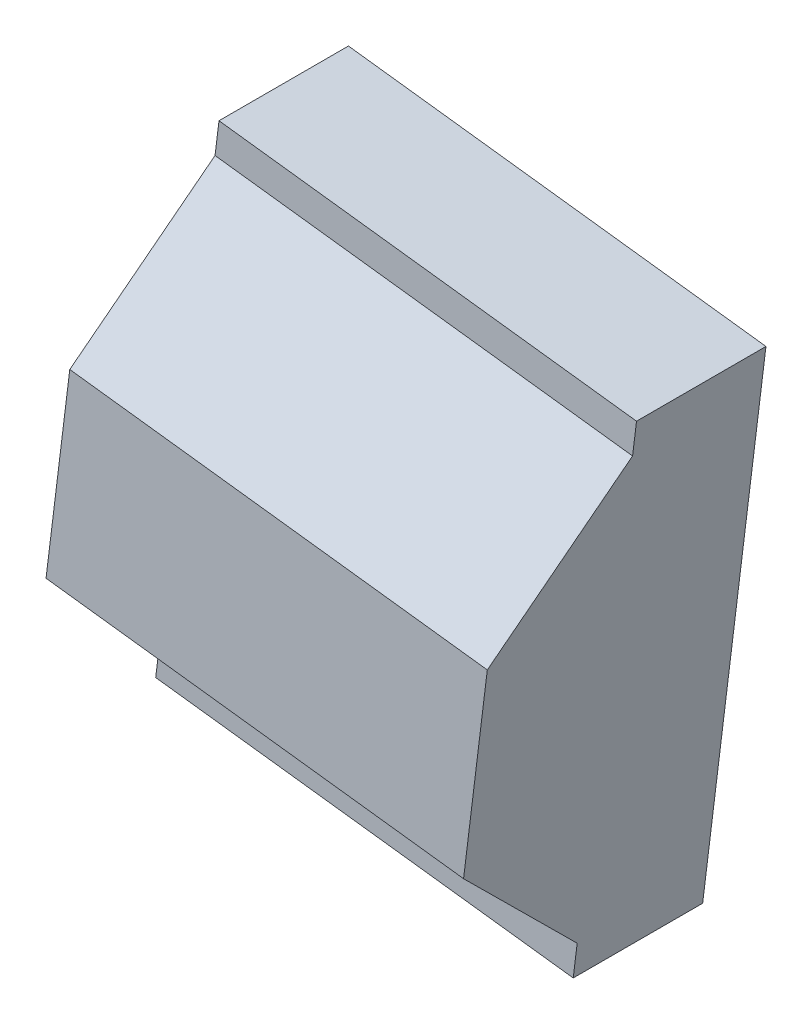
ISO-10303-21;
HEADER;
FILE_DESCRIPTION(('STEP AP214'),'2;1');
FILE_NAME('part.step','',(''),(''),'','','');
FILE_SCHEMA(('AUTOMOTIVE_DESIGN { 1 0 10303 214 1 1 1 1 }'));
ENDSEC;
DATA;
#1=APPLICATION_CONTEXT('core data for automotive mechanical design processes');
#2=APPLICATION_PROTOCOL_DEFINITION('international standard','automotive_design',2000,#1);
#3=PRODUCT_CONTEXT('',#1,'mechanical');
#4=PRODUCT('Part','Part','',(#3));
#5=PRODUCT_RELATED_PRODUCT_CATEGORY('part','',(#4));
#6=PRODUCT_DEFINITION_FORMATION('','',#4);
#7=PRODUCT_DEFINITION_CONTEXT('part definition',#1,'design');
#8=PRODUCT_DEFINITION('design','',#6,#7);
#9=PRODUCT_DEFINITION_SHAPE('','',#8);
#10=(LENGTH_UNIT() NAMED_UNIT(*) SI_UNIT(.MILLI.,.METRE.));
#11=(NAMED_UNIT(*) PLANE_ANGLE_UNIT() SI_UNIT($,.RADIAN.));
#12=(NAMED_UNIT(*) SI_UNIT($,.STERADIAN.) SOLID_ANGLE_UNIT());
#13=UNCERTAINTY_MEASURE_WITH_UNIT(LENGTH_MEASURE(1.E-05),#10,'distance_accuracy_value','');
#14=(GEOMETRIC_REPRESENTATION_CONTEXT(3) GLOBAL_UNCERTAINTY_ASSIGNED_CONTEXT((#13)) GLOBAL_UNIT_ASSIGNED_CONTEXT((#10,
#11,#12)) REPRESENTATION_CONTEXT('',''));
#15=CARTESIAN_POINT('',(0.,0.,0.));
#16=DIRECTION('',(0.,0.,1.));
#17=DIRECTION('',(1.,0.,0.));
#18=AXIS2_PLACEMENT_3D('',#15,#16,#17);
#19=CARTESIAN_POINT('',(54.4377734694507,-51.4921056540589,0.));
#20=DIRECTION('',(0.,0.,1.));
#21=DIRECTION('',(1.,0.,0.));
#22=AXIS2_PLACEMENT_3D('',#19,#20,#21);
#23=PLANE('',#22);
#24=DIRECTION('',(-0.122264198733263,-0.99249758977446,0.));
#25=VECTOR('',#24,1.);
#26=CARTESIAN_POINT('',(-34.7543167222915,55.465332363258,0.));
#27=LINE('',#26,#25);
#28=CARTESIAN_POINT('',(-47.1763593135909,-45.3724227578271,0.));
#29=VERTEX_POINT('',#28);
#30=CARTESIAN_POINT('',(-46.399981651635,-39.0700630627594,0.));
#31=VERTEX_POINT('',#30);
#32=EDGE_CURVE('E120',#29,#31,#27,.F.);
#33=ORIENTED_EDGE('',*,*,#32,.F.);
#34=DIRECTION('',(0.99249758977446,-0.122264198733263,0.));
#35=VECTOR('',#34,1.);
#36=CARTESIAN_POINT('',(53.6613958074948,-57.7944653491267,0.));
#37=LINE('',#36,#35);
#38=CARTESIAN_POINT('',(34.7543167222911,-55.465332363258,0.));
#39=VERTEX_POINT('',#38);
#40=EDGE_CURVE('E86',#39,#29,#37,.F.);
#41=ORIENTED_EDGE('',*,*,#40,.F.);
#42=DIRECTION('',(-0.122264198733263,-0.99249758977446,0.));
#43=VECTOR('',#42,1.);
#44=CARTESIAN_POINT('',(47.1763593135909,45.3724227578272,0.));
#45=LINE('',#44,#43);
#46=CARTESIAN_POINT('',(35.5306943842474,-49.1629726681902,0.));
#47=VERTEX_POINT('',#46);
#48=EDGE_CURVE('E83',#39,#47,#45,.F.);
#49=ORIENTED_EDGE('',*,*,#48,.T.);
#50=DIRECTION('',(0.992497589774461,-0.122264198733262,0.));
#51=VECTOR('',#50,1.);
#52=CARTESIAN_POINT('',(-46.3999816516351,-39.0700630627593,0.));
#53=LINE('',#52,#51);
#54=EDGE_CURVE('E19',#31,#47,#53,.T.);
#55=ORIENTED_EDGE('',*,*,#54,.F.);
#56=EDGE_LOOP('',(#33,#41,#49,#55));
#57=FACE_BOUND('',#56,.T.);
#58=ADVANCED_FACE('F16',(#57),#23,.T.);
#59=CARTESIAN_POINT('',(57.5432841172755,-26.2826668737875,25.4));
#60=DIRECTION('',(-0.0864538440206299,-0.701801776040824,0.707106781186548));
#61=DIRECTION('',(0.,-0.709764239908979,-0.704439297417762));
#62=AXIS2_PLACEMENT_3D('',#59,#60,#61);
#63=PLANE('',#62);
#64=DIRECTION('',(0.0864538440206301,0.701801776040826,0.707106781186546));
#65=VECTOR('',#64,1.);
#66=CARTESIAN_POINT('',(-46.3999816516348,-39.0700630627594,0.));
#67=LINE('',#66,#65);
#68=CARTESIAN_POINT('',(-43.2944710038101,-13.860624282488,25.4));
#69=VERTEX_POINT('',#68);
#70=EDGE_CURVE('E93',#31,#69,#67,.T.);
#71=ORIENTED_EDGE('',*,*,#70,.F.);
#72=ORIENTED_EDGE('',*,*,#54,.T.);
#73=DIRECTION('',(0.0864538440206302,0.701801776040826,0.707106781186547));
#74=VECTOR('',#73,1.);
#75=CARTESIAN_POINT('',(35.5306943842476,-49.1629726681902,0.));
#76=LINE('',#75,#74);
#77=CARTESIAN_POINT('',(38.6362050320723,-23.9535338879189,25.4));
#78=VERTEX_POINT('',#77);
#79=EDGE_CURVE('E78',#47,#78,#76,.T.);
#80=ORIENTED_EDGE('',*,*,#79,.T.);
#81=DIRECTION('',(0.992497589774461,-0.122264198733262,0.));
#82=VECTOR('',#81,1.);
#83=CARTESIAN_POINT('',(-43.2944710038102,-13.860624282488,25.4));
#84=LINE('',#83,#82);
#85=EDGE_CURVE('E95',#69,#78,#84,.T.);
#86=ORIENTED_EDGE('',*,*,#85,.F.);
#87=EDGE_LOOP('',(#71,#72,#80,#86));
#88=FACE_BOUND('',#87,.T.);
#89=ADVANCED_FACE('F91',(#88),#63,.T.);
#90=CARTESIAN_POINT('',(62.2015500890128,11.5314912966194,25.4));
#91=DIRECTION('',(0.,0.,1.));
#92=DIRECTION('',(1.,0.,0.));
#93=AXIS2_PLACEMENT_3D('',#90,#91,#92);
#94=PLANE('',#93);
#95=DIRECTION('',(-0.122264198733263,-0.99249758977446,0.));
#96=VECTOR('',#95,1.);
#97=CARTESIAN_POINT('',(-34.7543167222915,55.465332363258,25.4));
#98=LINE('',#97,#96);
#99=CARTESIAN_POINT('',(-38.6362050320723,23.953533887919,25.4));
#100=VERTEX_POINT('',#99);
#101=EDGE_CURVE('E113',#69,#100,#98,.F.);
#102=ORIENTED_EDGE('',*,*,#101,.F.);
#103=ORIENTED_EDGE('',*,*,#85,.T.);
#104=DIRECTION('',(-0.122264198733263,-0.99249758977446,0.));
#105=VECTOR('',#104,1.);
#106=CARTESIAN_POINT('',(47.1763593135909,45.3724227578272,25.4));
#107=LINE('',#106,#105);
#108=CARTESIAN_POINT('',(43.2944710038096,13.860624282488,25.4));
#109=VERTEX_POINT('',#108);
#110=EDGE_CURVE('E99',#78,#109,#107,.F.);
#111=ORIENTED_EDGE('',*,*,#110,.T.);
#112=DIRECTION('',(0.992497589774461,-0.122264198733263,0.));
#113=VECTOR('',#112,1.);
#114=CARTESIAN_POINT('',(-38.6362050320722,23.9535338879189,25.4));
#115=LINE('',#114,#113);
#116=EDGE_CURVE('E107',#100,#109,#115,.T.);
#117=ORIENTED_EDGE('',*,*,#116,.F.);
#118=EDGE_LOOP('',(#102,#103,#111,#117));
#119=FACE_BOUND('',#118,.T.);
#120=ADVANCED_FACE('F111',(#119),#94,.T.);
#121=CARTESIAN_POINT('',(65.3070607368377,36.7409300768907,0.));
#122=DIRECTION('',(0.08645384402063,0.701801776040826,0.707106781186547));
#123=DIRECTION('',(0.,-0.709764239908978,0.704439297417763));
#124=AXIS2_PLACEMENT_3D('',#121,#122,#123);
#125=PLANE('',#124);
#126=DIRECTION('',(0.0864538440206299,0.701801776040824,-0.707106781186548));
#127=VECTOR('',#126,1.);
#128=CARTESIAN_POINT('',(-38.6362050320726,23.953533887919,25.4));
#129=LINE('',#128,#127);
#130=CARTESIAN_POINT('',(-35.5306943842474,49.1629726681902,0.));
#131=VERTEX_POINT('',#130);
#132=EDGE_CURVE('E116',#100,#131,#129,.T.);
#133=ORIENTED_EDGE('',*,*,#132,.F.);
#134=ORIENTED_EDGE('',*,*,#116,.T.);
#135=DIRECTION('',(0.08645384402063,0.701801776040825,-0.707106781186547));
#136=VECTOR('',#135,1.);
#137=CARTESIAN_POINT('',(43.2944710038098,13.860624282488,25.4));
#138=LINE('',#137,#136);
#139=CARTESIAN_POINT('',(46.3999816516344,39.0700630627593,0.));
#140=VERTEX_POINT('',#139);
#141=EDGE_CURVE('E101',#109,#140,#138,.T.);
#142=ORIENTED_EDGE('',*,*,#141,.T.);
#143=DIRECTION('',(0.99249758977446,-0.122264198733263,0.));
#144=VECTOR('',#143,1.);
#145=CARTESIAN_POINT('',(-35.5306943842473,49.1629726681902,0.));
#146=LINE('',#145,#144);
#147=EDGE_CURVE('E89',#131,#140,#146,.T.);
#148=ORIENTED_EDGE('',*,*,#147,.F.);
#149=EDGE_LOOP('',(#133,#134,#142,#148));
#150=FACE_BOUND('',#149,.T.);
#151=ADVANCED_FACE('F134',(#150),#125,.T.);
#152=CARTESIAN_POINT('',(66.0834383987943,43.0432897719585,0.));
#153=DIRECTION('',(0.,0.,1.));
#154=DIRECTION('',(1.,0.,0.));
#155=AXIS2_PLACEMENT_3D('',#152,#153,#154);
#156=PLANE('',#155);
#157=DIRECTION('',(-0.122264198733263,-0.99249758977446,0.));
#158=VECTOR('',#157,1.);
#159=CARTESIAN_POINT('',(-34.7543167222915,55.465332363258,0.));
#160=LINE('',#159,#158);
#161=CARTESIAN_POINT('',(-34.7543167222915,55.465332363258,0.));
#162=VERTEX_POINT('',#161);
#163=EDGE_CURVE('E127',#131,#162,#160,.F.);
#164=ORIENTED_EDGE('',*,*,#163,.F.);
#165=ORIENTED_EDGE('',*,*,#147,.T.);
#166=DIRECTION('',(-0.122264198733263,-0.99249758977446,0.));
#167=VECTOR('',#166,1.);
#168=CARTESIAN_POINT('',(47.1763593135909,45.3724227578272,0.));
#169=LINE('',#168,#167);
#170=CARTESIAN_POINT('',(47.1763593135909,45.3724227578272,0.));
#171=VERTEX_POINT('',#170);
#172=EDGE_CURVE('E132',#140,#171,#169,.F.);
#173=ORIENTED_EDGE('',*,*,#172,.T.);
#174=DIRECTION('',(-0.99249758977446,0.122264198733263,0.));
#175=VECTOR('',#174,1.);
#176=CARTESIAN_POINT('',(66.0834383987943,43.0432897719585,0.));
#177=LINE('',#176,#175);
#178=EDGE_CURVE('E148',#162,#171,#177,.F.);
#179=ORIENTED_EDGE('',*,*,#178,.F.);
#180=EDGE_LOOP('',(#164,#165,#173,#179));
#181=FACE_BOUND('',#180,.T.);
#182=ADVANCED_FACE('F138',(#181),#156,.T.);
#183=CARTESIAN_POINT('',(47.1763593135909,45.3724227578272,0.));
#184=DIRECTION('',(-0.99249758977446,0.122264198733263,0.));
#185=DIRECTION('',(-0.122264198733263,-0.99249758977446,0.));
#186=AXIS2_PLACEMENT_3D('',#183,#184,#185);
#187=PLANE('',#186);
#188=ORIENTED_EDGE('',*,*,#141,.F.);
#189=ORIENTED_EDGE('',*,*,#110,.F.);
#190=ORIENTED_EDGE('',*,*,#79,.F.);
#191=ORIENTED_EDGE('',*,*,#48,.F.);
#192=DIRECTION('',(0.,0.,1.));
#193=VECTOR('',#192,1.);
#194=CARTESIAN_POINT('',(34.7543167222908,-55.4653323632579,0.));
#195=LINE('',#194,#193);
#196=CARTESIAN_POINT('',(34.7543167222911,-55.465332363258,-25.4));
#197=VERTEX_POINT('',#196);
#198=EDGE_CURVE('E130',#197,#39,#195,.T.);
#199=ORIENTED_EDGE('',*,*,#198,.F.);
#200=DIRECTION('',(-0.122264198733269,-0.99249758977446,0.));
#201=VECTOR('',#200,1.);
#202=CARTESIAN_POINT('',(47.1763593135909,45.3724227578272,-25.4));
#203=LINE('',#202,#201);
#204=CARTESIAN_POINT('',(47.1763593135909,45.3724227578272,-25.4));
#205=VERTEX_POINT('',#204);
#206=EDGE_CURVE('E145',#205,#197,#203,.T.);
#207=ORIENTED_EDGE('',*,*,#206,.F.);
#208=DIRECTION('',(0.,0.,1.));
#209=VECTOR('',#208,1.);
#210=CARTESIAN_POINT('',(47.1763593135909,45.3724227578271,-25.4));
#211=LINE('',#210,#209);
#212=EDGE_CURVE('E142',#171,#205,#211,.F.);
#213=ORIENTED_EDGE('',*,*,#212,.F.);
#214=ORIENTED_EDGE('',*,*,#172,.F.);
#215=EDGE_LOOP('',(#188,#189,#190,#191,#199,#207,#213,#214));
#216=FACE_BOUND('',#215,.T.);
#217=ADVANCED_FACE('F98',(#216),#187,.F.);
#218=CARTESIAN_POINT('',(53.6613958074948,-57.7944653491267,0.));
#219=DIRECTION('',(-0.122264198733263,-0.99249758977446,0.));
#220=DIRECTION('',(0.99249758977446,-0.122264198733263,0.));
#221=AXIS2_PLACEMENT_3D('',#218,#219,#220);
#222=PLANE('',#221);
#223=DIRECTION('',(0.,0.,1.));
#224=VECTOR('',#223,1.);
#225=CARTESIAN_POINT('',(-47.176359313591,-45.3724227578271,0.));
#226=LINE('',#225,#224);
#227=CARTESIAN_POINT('',(-47.1763593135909,-45.3724227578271,-25.4));
#228=VERTEX_POINT('',#227);
#229=EDGE_CURVE('E122',#228,#29,#226,.T.);
#230=ORIENTED_EDGE('',*,*,#229,.F.);
#231=DIRECTION('',(-0.99249758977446,0.122264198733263,0.));
#232=VECTOR('',#231,1.);
#233=CARTESIAN_POINT('',(34.7543167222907,-55.465332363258,-25.4));
#234=LINE('',#233,#232);
#235=EDGE_CURVE('E151',#197,#228,#234,.T.);
#236=ORIENTED_EDGE('',*,*,#235,.F.);
#237=ORIENTED_EDGE('',*,*,#198,.T.);
#238=ORIENTED_EDGE('',*,*,#40,.T.);
#239=EDGE_LOOP('',(#230,#236,#237,#238));
#240=FACE_BOUND('',#239,.T.);
#241=ADVANCED_FACE('F162',(#240),#222,.T.);
#242=CARTESIAN_POINT('',(-34.7543167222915,55.465332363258,0.));
#243=DIRECTION('',(-0.99249758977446,0.122264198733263,0.));
#244=DIRECTION('',(-0.122264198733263,-0.99249758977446,0.));
#245=AXIS2_PLACEMENT_3D('',#242,#243,#244);
#246=PLANE('',#245);
#247=ORIENTED_EDGE('',*,*,#101,.T.);
#248=ORIENTED_EDGE('',*,*,#132,.T.);
#249=ORIENTED_EDGE('',*,*,#163,.T.);
#250=DIRECTION('',(0.,0.,1.));
#251=VECTOR('',#250,1.);
#252=CARTESIAN_POINT('',(-34.7543167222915,55.4653323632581,-25.4));
#253=LINE('',#252,#251);
#254=CARTESIAN_POINT('',(-34.7543167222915,55.465332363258,-25.4));
#255=VERTEX_POINT('',#254);
#256=EDGE_CURVE('E34',#255,#162,#253,.T.);
#257=ORIENTED_EDGE('',*,*,#256,.F.);
#258=DIRECTION('',(0.122264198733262,0.99249758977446,0.));
#259=VECTOR('',#258,1.);
#260=CARTESIAN_POINT('',(-47.1763593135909,-45.3724227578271,-25.4));
#261=LINE('',#260,#259);
#262=EDGE_CURVE('E25',#228,#255,#261,.T.);
#263=ORIENTED_EDGE('',*,*,#262,.F.);
#264=ORIENTED_EDGE('',*,*,#229,.T.);
#265=ORIENTED_EDGE('',*,*,#32,.T.);
#266=ORIENTED_EDGE('',*,*,#70,.T.);
#267=EDGE_LOOP('',(#247,#248,#249,#257,#263,#264,#265,#266));
#268=FACE_BOUND('',#267,.T.);
#269=ADVANCED_FACE('F118',(#268),#246,.T.);
#270=CARTESIAN_POINT('',(66.0834383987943,43.0432897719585,-25.4));
#271=DIRECTION('',(0.122264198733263,0.99249758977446,0.));
#272=DIRECTION('',(-0.99249758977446,0.122264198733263,0.));
#273=AXIS2_PLACEMENT_3D('',#270,#271,#272);
#274=PLANE('',#273);
#275=ORIENTED_EDGE('',*,*,#256,.T.);
#276=ORIENTED_EDGE('',*,*,#178,.T.);
#277=ORIENTED_EDGE('',*,*,#212,.T.);
#278=DIRECTION('',(0.992497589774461,-0.122264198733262,0.));
#279=VECTOR('',#278,1.);
#280=CARTESIAN_POINT('',(-34.7543167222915,55.465332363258,-25.4));
#281=LINE('',#280,#279);
#282=EDGE_CURVE('E11',#255,#205,#281,.T.);
#283=ORIENTED_EDGE('',*,*,#282,.F.);
#284=EDGE_LOOP('',(#275,#276,#277,#283));
#285=FACE_BOUND('',#284,.T.);
#286=ADVANCED_FACE('F149',(#285),#274,.T.);
#287=CARTESIAN_POINT('',(53.6613958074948,-57.7944653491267,-25.4));
#288=DIRECTION('',(0.,0.,-1.));
#289=DIRECTION('',(-1.,0.,0.));
#290=AXIS2_PLACEMENT_3D('',#287,#288,#289);
#291=PLANE('',#290);
#292=ORIENTED_EDGE('',*,*,#262,.T.);
#293=ORIENTED_EDGE('',*,*,#282,.T.);
#294=ORIENTED_EDGE('',*,*,#206,.T.);
#295=ORIENTED_EDGE('',*,*,#235,.T.);
#296=EDGE_LOOP('',(#292,#293,#294,#295));
#297=FACE_BOUND('',#296,.T.);
#298=ADVANCED_FACE('F159',(#297),#291,.T.);
#299=CLOSED_SHELL('',(#58,#89,#120,#151,#182,#217,#241,#269,#286,#298));
#300=MANIFOLD_SOLID_BREP('B1',#299);
#301=ADVANCED_BREP_SHAPE_REPRESENTATION('',(#18,#300),#14);
#302=SHAPE_DEFINITION_REPRESENTATION(#9,#301);
ENDSEC;
END-ISO-10303-21;
